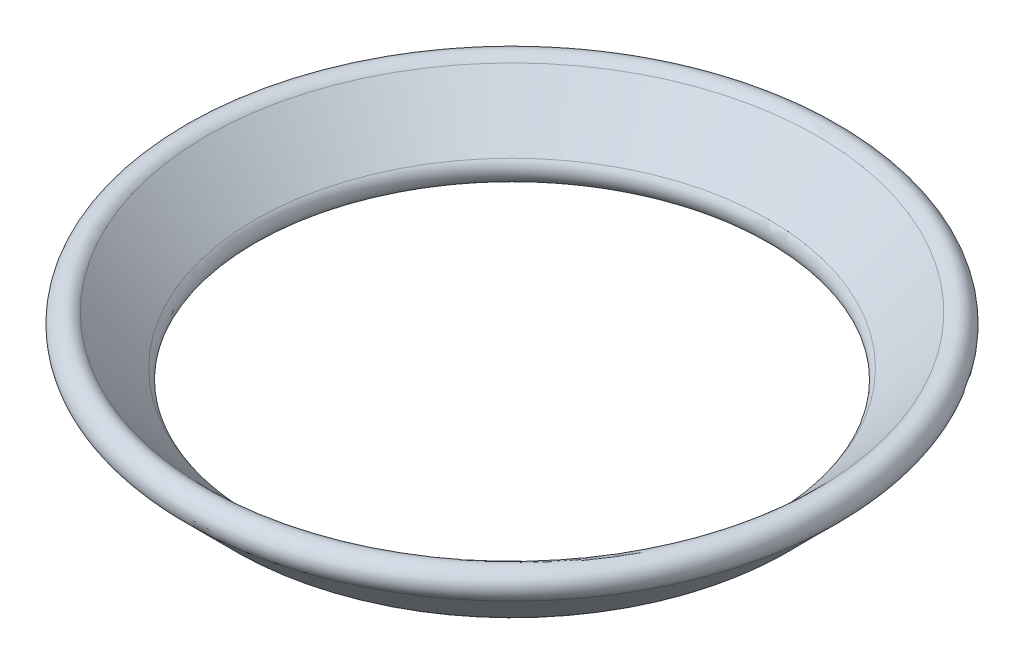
ISO-10303-21;
HEADER;
FILE_DESCRIPTION(('STEP AP214'),'2;1');
FILE_NAME('part.step','',(''),(''),'','','');
FILE_SCHEMA(('AUTOMOTIVE_DESIGN { 1 0 10303 214 1 1 1 1 }'));
ENDSEC;
DATA;
#1=APPLICATION_CONTEXT('core data for automotive mechanical design processes');
#2=APPLICATION_PROTOCOL_DEFINITION('international standard','automotive_design',2000,#1);
#3=PRODUCT_CONTEXT('',#1,'mechanical');
#4=PRODUCT('Part','Part','',(#3));
#5=PRODUCT_RELATED_PRODUCT_CATEGORY('part','',(#4));
#6=PRODUCT_DEFINITION_FORMATION('','',#4);
#7=PRODUCT_DEFINITION_CONTEXT('part definition',#1,'design');
#8=PRODUCT_DEFINITION('design','',#6,#7);
#9=PRODUCT_DEFINITION_SHAPE('','',#8);
#10=(LENGTH_UNIT() NAMED_UNIT(*) SI_UNIT(.MILLI.,.METRE.));
#11=(NAMED_UNIT(*) PLANE_ANGLE_UNIT() SI_UNIT($,.RADIAN.));
#12=(NAMED_UNIT(*) SI_UNIT($,.STERADIAN.) SOLID_ANGLE_UNIT());
#13=UNCERTAINTY_MEASURE_WITH_UNIT(LENGTH_MEASURE(1.E-05),#10,'distance_accuracy_value','');
#14=(GEOMETRIC_REPRESENTATION_CONTEXT(3) GLOBAL_UNCERTAINTY_ASSIGNED_CONTEXT((#13)) GLOBAL_UNIT_ASSIGNED_CONTEXT((#10,
#11,#12)) REPRESENTATION_CONTEXT('',''));
#15=CARTESIAN_POINT('',(0.,0.,0.));
#16=DIRECTION('',(0.,0.,1.));
#17=DIRECTION('',(1.,0.,0.));
#18=AXIS2_PLACEMENT_3D('',#15,#16,#17);
#19=CARTESIAN_POINT('',(60.2330251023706,-9.83232615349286,0.));
#20=DIRECTION('',(0.,1.,0.));
#21=DIRECTION('',(-1.,0.,0.));
#22=AXIS2_PLACEMENT_3D('',#19,#20,#21);
#23=TOROIDAL_SURFACE('',#22,13.8419417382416,0.625000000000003);
#24=CARTESIAN_POINT('',(60.2330251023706,-10.2742678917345,0.));
#25=DIRECTION('',(0.,1.,0.));
#26=DIRECTION('',(-1.,0.,0.));
#27=AXIS2_PLACEMENT_3D('',#24,#25,#26);
#28=CIRCLE('',#27,14.2838834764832);
#29=CARTESIAN_POINT('',(45.9491416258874,-10.2742678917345,0.));
#30=VERTEX_POINT('',#29);
#31=EDGE_CURVE('E10',#30,#30,#28,.T.);
#32=ORIENTED_EDGE('',*,*,#31,.T.);
#33=EDGE_LOOP('',(#32));
#34=FACE_BOUND('',#33,.T.);
#35=CARTESIAN_POINT('',(60.2330251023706,-9.39038441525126,0.));
#36=DIRECTION('',(0.,1.,0.));
#37=DIRECTION('',(-1.,0.,0.));
#38=AXIS2_PLACEMENT_3D('',#35,#36,#37);
#39=CIRCLE('',#38,13.4);
#40=CARTESIAN_POINT('',(46.8330251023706,-9.39038441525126,0.));
#41=VERTEX_POINT('',#40);
#42=EDGE_CURVE('E38',#41,#41,#39,.T.);
#43=ORIENTED_EDGE('',*,*,#42,.F.);
#44=EDGE_LOOP('',(#43));
#45=FACE_BOUND('',#44,.T.);
#46=ADVANCED_FACE('F24',(#34,#45),#23,.T.);
#47=CARTESIAN_POINT('',(60.2330251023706,-10.2742678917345,0.));
#48=DIRECTION('',(0.,1.,0.));
#49=DIRECTION('',(-1.,0.,0.));
#50=AXIS2_PLACEMENT_3D('',#47,#48,#49);
#51=CONICAL_SURFACE('',#50,14.2838834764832,0.78539816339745);
#52=CARTESIAN_POINT('',(60.2330251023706,-12.3955882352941,0.));
#53=DIRECTION('',(0.,1.,0.));
#54=DIRECTION('',(-1.,0.,0.));
#55=AXIS2_PLACEMENT_3D('',#52,#53,#54);
#56=CIRCLE('',#55,12.1625631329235);
#57=CARTESIAN_POINT('',(48.070461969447,-12.3955882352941,0.));
#58=VERTEX_POINT('',#57);
#59=EDGE_CURVE('E30',#58,#58,#56,.T.);
#60=ORIENTED_EDGE('',*,*,#59,.T.);
#61=EDGE_LOOP('',(#60));
#62=FACE_BOUND('',#61,.T.);
#63=ORIENTED_EDGE('',*,*,#31,.F.);
#64=EDGE_LOOP('',(#63));
#65=FACE_BOUND('',#64,.T.);
#66=ADVANCED_FACE('F47',(#62,#65),#51,.T.);
#67=CARTESIAN_POINT('',(60.2330251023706,-11.9536464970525,0.));
#68=DIRECTION('',(0.,1.,0.));
#69=DIRECTION('',(-1.,0.,0.));
#70=AXIS2_PLACEMENT_3D('',#67,#68,#69);
#71=TOROIDAL_SURFACE('',#70,11.7206213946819,0.625000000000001);
#72=ORIENTED_EDGE('',*,*,#59,.F.);
#73=EDGE_LOOP('',(#72));
#74=FACE_BOUND('',#73,.T.);
#75=CARTESIAN_POINT('',(60.2330251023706,-11.5117047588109,0.));
#76=DIRECTION('',(0.,1.,0.));
#77=DIRECTION('',(-1.,0.,0.));
#78=AXIS2_PLACEMENT_3D('',#75,#76,#77);
#79=CIRCLE('',#78,11.2786796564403);
#80=CARTESIAN_POINT('',(48.9543454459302,-11.5117047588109,0.));
#81=VERTEX_POINT('',#80);
#82=EDGE_CURVE('E34',#81,#81,#79,.T.);
#83=ORIENTED_EDGE('',*,*,#82,.T.);
#84=EDGE_LOOP('',(#83));
#85=FACE_BOUND('',#84,.T.);
#86=ADVANCED_FACE('F51',(#74,#85),#71,.T.);
#87=CARTESIAN_POINT('',(60.2330251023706,-9.39038441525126,0.));
#88=DIRECTION('',(0.,1.,0.));
#89=DIRECTION('',(-1.,0.,0.));
#90=AXIS2_PLACEMENT_3D('',#87,#88,#89);
#91=CONICAL_SURFACE('',#90,13.4,0.785398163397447);
#92=ORIENTED_EDGE('',*,*,#82,.F.);
#93=EDGE_LOOP('',(#92));
#94=FACE_BOUND('',#93,.T.);
#95=ORIENTED_EDGE('',*,*,#42,.T.);
#96=EDGE_LOOP('',(#95));
#97=FACE_BOUND('',#96,.T.);
#98=ADVANCED_FACE('F44',(#94,#97),#91,.F.);
#99=CLOSED_SHELL('',(#46,#66,#86,#98));
#100=MANIFOLD_SOLID_BREP('B2',#99);
#101=ADVANCED_BREP_SHAPE_REPRESENTATION('',(#18,#100),#14);
#102=SHAPE_DEFINITION_REPRESENTATION(#9,#101);
ENDSEC;
END-ISO-10303-21;
